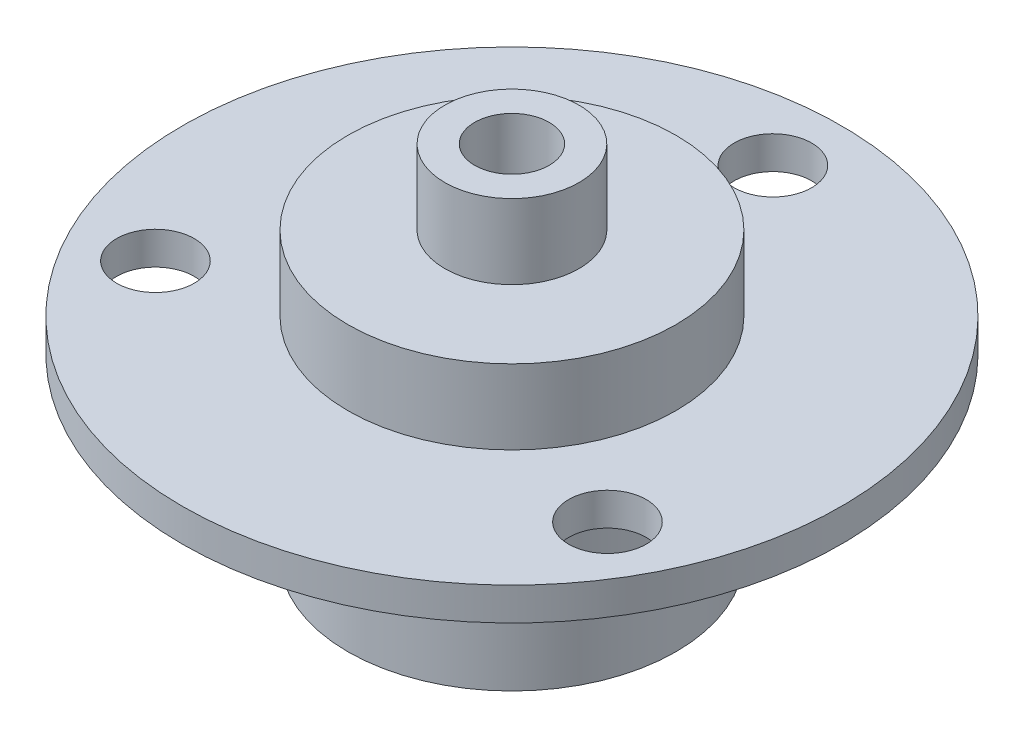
ISO-10303-21;
HEADER;
FILE_DESCRIPTION(('STEP AP214'),'2;1');
FILE_NAME('part.step','',(''),(''),'','','');
FILE_SCHEMA(('AUTOMOTIVE_DESIGN { 1 0 10303 214 1 1 1 1 }'));
ENDSEC;
DATA;
#1=APPLICATION_CONTEXT('core data for automotive mechanical design processes');
#2=APPLICATION_PROTOCOL_DEFINITION('international standard','automotive_design',2000,#1);
#3=PRODUCT_CONTEXT('',#1,'mechanical');
#4=PRODUCT('Part','Part','',(#3));
#5=PRODUCT_RELATED_PRODUCT_CATEGORY('part','',(#4));
#6=PRODUCT_DEFINITION_FORMATION('','',#4);
#7=PRODUCT_DEFINITION_CONTEXT('part definition',#1,'design');
#8=PRODUCT_DEFINITION('design','',#6,#7);
#9=PRODUCT_DEFINITION_SHAPE('','',#8);
#10=(LENGTH_UNIT() NAMED_UNIT(*) SI_UNIT(.MILLI.,.METRE.));
#11=(NAMED_UNIT(*) PLANE_ANGLE_UNIT() SI_UNIT($,.RADIAN.));
#12=(NAMED_UNIT(*) SI_UNIT($,.STERADIAN.) SOLID_ANGLE_UNIT());
#13=UNCERTAINTY_MEASURE_WITH_UNIT(LENGTH_MEASURE(1.E-05),#10,'distance_accuracy_value','');
#14=(GEOMETRIC_REPRESENTATION_CONTEXT(3) GLOBAL_UNCERTAINTY_ASSIGNED_CONTEXT((#13)) GLOBAL_UNIT_ASSIGNED_CONTEXT((#10,
#11,#12)) REPRESENTATION_CONTEXT('',''));
#15=CARTESIAN_POINT('',(0.,0.,0.));
#16=DIRECTION('',(0.,0.,1.));
#17=DIRECTION('',(1.,0.,0.));
#18=AXIS2_PLACEMENT_3D('',#15,#16,#17);
#19=CARTESIAN_POINT('',(0.,2.2,0.));
#20=DIRECTION('',(0.,-1.,0.));
#21=DIRECTION('',(0.,0.,-1.));
#22=AXIS2_PLACEMENT_3D('',#19,#20,#21);
#23=CYLINDRICAL_SURFACE('',#22,22.1);
#24=CARTESIAN_POINT('',(0.,2.2,0.));
#25=DIRECTION('',(0.,1.,0.));
#26=DIRECTION('',(0.,0.,1.));
#27=AXIS2_PLACEMENT_3D('',#24,#25,#26);
#28=CIRCLE('',#27,22.1);
#29=CARTESIAN_POINT('',(0.,2.2,22.1));
#30=VERTEX_POINT('',#29);
#31=EDGE_CURVE('E47',#30,#30,#28,.T.);
#32=ORIENTED_EDGE('',*,*,#31,.F.);
#33=EDGE_LOOP('',(#32));
#34=FACE_BOUND('',#33,.T.);
#35=CARTESIAN_POINT('',(0.,0.,0.));
#36=DIRECTION('',(0.,1.,0.));
#37=DIRECTION('',(0.,0.,1.));
#38=AXIS2_PLACEMENT_3D('',#35,#36,#37);
#39=CIRCLE('',#38,22.1);
#40=CARTESIAN_POINT('',(0.,0.,22.1));
#41=VERTEX_POINT('',#40);
#42=EDGE_CURVE('E79',#41,#41,#39,.T.);
#43=ORIENTED_EDGE('',*,*,#42,.T.);
#44=EDGE_LOOP('',(#43));
#45=FACE_BOUND('',#44,.T.);
#46=ADVANCED_FACE('F35',(#34,#45),#23,.T.);
#47=CARTESIAN_POINT('',(0.,2.2,0.));
#48=DIRECTION('',(0.,1.,0.));
#49=DIRECTION('',(0.,0.,1.));
#50=AXIS2_PLACEMENT_3D('',#47,#48,#49);
#51=PLANE('',#50);
#52=CARTESIAN_POINT('',(0.,2.2,0.));
#53=DIRECTION('',(0.,1.,0.));
#54=DIRECTION('',(0.,0.,1.));
#55=AXIS2_PLACEMENT_3D('',#52,#53,#54);
#56=CIRCLE('',#55,11.);
#57=CARTESIAN_POINT('',(0.,2.2,11.));
#58=VERTEX_POINT('',#57);
#59=EDGE_CURVE('E55',#58,#58,#56,.T.);
#60=ORIENTED_EDGE('',*,*,#59,.F.);
#61=EDGE_LOOP('',(#60));
#62=FACE_BOUND('',#61,.T.);
#63=CARTESIAN_POINT('',(0.,2.2,-17.5));
#64=DIRECTION('',(0.,1.,0.));
#65=DIRECTION('',(0.,0.,1.));
#66=AXIS2_PLACEMENT_3D('',#63,#64,#65);
#67=CIRCLE('',#66,2.6);
#68=CARTESIAN_POINT('',(0.,2.2,-14.9));
#69=VERTEX_POINT('',#68);
#70=EDGE_CURVE('E76',#69,#69,#67,.T.);
#71=ORIENTED_EDGE('',*,*,#70,.F.);
#72=EDGE_LOOP('',(#71));
#73=FACE_BOUND('',#72,.T.);
#74=CARTESIAN_POINT('',(15.1554445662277,2.2,8.75));
#75=DIRECTION('',(0.,1.,0.));
#76=DIRECTION('',(0.,0.,1.));
#77=AXIS2_PLACEMENT_3D('',#74,#75,#76);
#78=CIRCLE('',#77,2.60000000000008);
#79=CARTESIAN_POINT('',(15.1554445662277,2.2,11.3500000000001));
#80=VERTEX_POINT('',#79);
#81=EDGE_CURVE('E73',#80,#80,#78,.T.);
#82=ORIENTED_EDGE('',*,*,#81,.F.);
#83=EDGE_LOOP('',(#82));
#84=FACE_BOUND('',#83,.T.);
#85=CARTESIAN_POINT('',(-15.1554445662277,2.2,8.75000000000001));
#86=DIRECTION('',(0.,1.,0.));
#87=DIRECTION('',(0.,0.,1.));
#88=AXIS2_PLACEMENT_3D('',#85,#86,#87);
#89=CIRCLE('',#88,2.60000000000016);
#90=CARTESIAN_POINT('',(-15.1554445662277,2.2,11.3500000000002));
#91=VERTEX_POINT('',#90);
#92=EDGE_CURVE('E65',#91,#91,#89,.T.);
#93=ORIENTED_EDGE('',*,*,#92,.F.);
#94=EDGE_LOOP('',(#93));
#95=FACE_BOUND('',#94,.T.);
#96=ORIENTED_EDGE('',*,*,#31,.T.);
#97=EDGE_LOOP('',(#96));
#98=FACE_BOUND('',#97,.T.);
#99=ADVANCED_FACE('F89',(#62,#73,#84,#95,#98),#51,.T.);
#100=CARTESIAN_POINT('',(0.,0.,0.));
#101=DIRECTION('',(0.,1.,0.));
#102=DIRECTION('',(0.,0.,1.));
#103=AXIS2_PLACEMENT_3D('',#100,#101,#102);
#104=PLANE('',#103);
#105=CARTESIAN_POINT('',(0.,0.,0.));
#106=DIRECTION('',(0.,1.,0.));
#107=DIRECTION('',(0.,0.,1.));
#108=AXIS2_PLACEMENT_3D('',#105,#106,#107);
#109=CIRCLE('',#108,11.);
#110=CARTESIAN_POINT('',(0.,0.,11.));
#111=VERTEX_POINT('',#110);
#112=EDGE_CURVE('E42',#111,#111,#109,.F.);
#113=ORIENTED_EDGE('',*,*,#112,.F.);
#114=EDGE_LOOP('',(#113));
#115=FACE_BOUND('',#114,.T.);
#116=CARTESIAN_POINT('',(0.,0.,-17.5));
#117=DIRECTION('',(0.,1.,0.));
#118=DIRECTION('',(0.,0.,1.));
#119=AXIS2_PLACEMENT_3D('',#116,#117,#118);
#120=CIRCLE('',#119,2.6);
#121=CARTESIAN_POINT('',(0.,0.,-14.9));
#122=VERTEX_POINT('',#121);
#123=EDGE_CURVE('E62',#122,#122,#120,.T.);
#124=ORIENTED_EDGE('',*,*,#123,.T.);
#125=EDGE_LOOP('',(#124));
#126=FACE_BOUND('',#125,.T.);
#127=CARTESIAN_POINT('',(15.1554445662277,0.,8.75));
#128=DIRECTION('',(0.,1.,0.));
#129=DIRECTION('',(0.,0.,1.));
#130=AXIS2_PLACEMENT_3D('',#127,#128,#129);
#131=CIRCLE('',#130,2.60000000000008);
#132=CARTESIAN_POINT('',(15.1554445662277,0.,11.3500000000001));
#133=VERTEX_POINT('',#132);
#134=EDGE_CURVE('E66',#133,#133,#131,.T.);
#135=ORIENTED_EDGE('',*,*,#134,.T.);
#136=EDGE_LOOP('',(#135));
#137=FACE_BOUND('',#136,.T.);
#138=CARTESIAN_POINT('',(-15.1554445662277,0.,8.75000000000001));
#139=DIRECTION('',(0.,1.,0.));
#140=DIRECTION('',(0.,0.,1.));
#141=AXIS2_PLACEMENT_3D('',#138,#139,#140);
#142=CIRCLE('',#141,2.60000000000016);
#143=CARTESIAN_POINT('',(-15.1554445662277,0.,11.3500000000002));
#144=VERTEX_POINT('',#143);
#145=EDGE_CURVE('E59',#144,#144,#142,.T.);
#146=ORIENTED_EDGE('',*,*,#145,.T.);
#147=EDGE_LOOP('',(#146));
#148=FACE_BOUND('',#147,.T.);
#149=ORIENTED_EDGE('',*,*,#42,.F.);
#150=EDGE_LOOP('',(#149));
#151=FACE_BOUND('',#150,.T.);
#152=ADVANCED_FACE('F86',(#115,#126,#137,#148,#151),#104,.F.);
#153=CARTESIAN_POINT('',(-15.1554445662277,0.,8.75000000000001));
#154=DIRECTION('',(0.,1.,0.));
#155=DIRECTION('',(0.,0.,1.));
#156=AXIS2_PLACEMENT_3D('',#153,#154,#155);
#157=CYLINDRICAL_SURFACE('',#156,2.60000000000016);
#158=ORIENTED_EDGE('',*,*,#92,.T.);
#159=EDGE_LOOP('',(#158));
#160=FACE_BOUND('',#159,.T.);
#161=ORIENTED_EDGE('',*,*,#145,.F.);
#162=EDGE_LOOP('',(#161));
#163=FACE_BOUND('',#162,.T.);
#164=ADVANCED_FACE('F88',(#160,#163),#157,.F.);
#165=CARTESIAN_POINT('',(15.1554445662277,0.,8.75));
#166=DIRECTION('',(0.,1.,0.));
#167=DIRECTION('',(0.,0.,1.));
#168=AXIS2_PLACEMENT_3D('',#165,#166,#167);
#169=CYLINDRICAL_SURFACE('',#168,2.60000000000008);
#170=ORIENTED_EDGE('',*,*,#81,.T.);
#171=EDGE_LOOP('',(#170));
#172=FACE_BOUND('',#171,.T.);
#173=ORIENTED_EDGE('',*,*,#134,.F.);
#174=EDGE_LOOP('',(#173));
#175=FACE_BOUND('',#174,.T.);
#176=ADVANCED_FACE('F95',(#172,#175),#169,.F.);
#177=CARTESIAN_POINT('',(0.,0.,-17.5));
#178=DIRECTION('',(0.,1.,0.));
#179=DIRECTION('',(0.,0.,1.));
#180=AXIS2_PLACEMENT_3D('',#177,#178,#179);
#181=CYLINDRICAL_SURFACE('',#180,2.6);
#182=ORIENTED_EDGE('',*,*,#70,.T.);
#183=EDGE_LOOP('',(#182));
#184=FACE_BOUND('',#183,.T.);
#185=ORIENTED_EDGE('',*,*,#123,.F.);
#186=EDGE_LOOP('',(#185));
#187=FACE_BOUND('',#186,.T.);
#188=ADVANCED_FACE('F121',(#184,#187),#181,.F.);
#189=CARTESIAN_POINT('',(0.,7.2,0.));
#190=DIRECTION('',(0.,-1.,0.));
#191=DIRECTION('',(0.,0.,-1.));
#192=AXIS2_PLACEMENT_3D('',#189,#190,#191);
#193=CYLINDRICAL_SURFACE('',#192,11.);
#194=CARTESIAN_POINT('',(0.,7.2,0.));
#195=DIRECTION('',(0.,1.,0.));
#196=DIRECTION('',(0.,0.,1.));
#197=AXIS2_PLACEMENT_3D('',#194,#195,#196);
#198=CIRCLE('',#197,11.);
#199=CARTESIAN_POINT('',(0.,7.2,11.));
#200=VERTEX_POINT('',#199);
#201=EDGE_CURVE('E56',#200,#200,#198,.T.);
#202=ORIENTED_EDGE('',*,*,#201,.F.);
#203=EDGE_LOOP('',(#202));
#204=FACE_BOUND('',#203,.T.);
#205=ORIENTED_EDGE('',*,*,#59,.T.);
#206=EDGE_LOOP('',(#205));
#207=FACE_BOUND('',#206,.T.);
#208=ADVANCED_FACE('F126',(#204,#207),#193,.T.);
#209=CARTESIAN_POINT('',(0.,7.2,0.));
#210=DIRECTION('',(0.,1.,0.));
#211=DIRECTION('',(0.,0.,1.));
#212=AXIS2_PLACEMENT_3D('',#209,#210,#211);
#213=PLANE('',#212);
#214=CARTESIAN_POINT('',(0.,7.2,0.));
#215=DIRECTION('',(0.,1.,0.));
#216=DIRECTION('',(0.,0.,1.));
#217=AXIS2_PLACEMENT_3D('',#214,#215,#216);
#218=CIRCLE('',#217,4.5);
#219=CARTESIAN_POINT('',(0.,7.2,4.5));
#220=VERTEX_POINT('',#219);
#221=EDGE_CURVE('E10',#220,#220,#218,.T.);
#222=ORIENTED_EDGE('',*,*,#221,.F.);
#223=EDGE_LOOP('',(#222));
#224=FACE_BOUND('',#223,.T.);
#225=ORIENTED_EDGE('',*,*,#201,.T.);
#226=EDGE_LOOP('',(#225));
#227=FACE_BOUND('',#226,.T.);
#228=ADVANCED_FACE('F130',(#224,#227),#213,.T.);
#229=CARTESIAN_POINT('',(0.,-11.8,0.));
#230=DIRECTION('',(0.,1.,0.));
#231=DIRECTION('',(0.,0.,1.));
#232=AXIS2_PLACEMENT_3D('',#229,#230,#231);
#233=CYLINDRICAL_SURFACE('',#232,11.);
#234=CARTESIAN_POINT('',(0.,-11.8,0.));
#235=DIRECTION('',(0.,-1.,0.));
#236=DIRECTION('',(0.,0.,-1.));
#237=AXIS2_PLACEMENT_3D('',#234,#235,#236);
#238=CIRCLE('',#237,11.);
#239=CARTESIAN_POINT('',(0.,-11.8,-11.));
#240=VERTEX_POINT('',#239);
#241=EDGE_CURVE('E52',#240,#240,#238,.T.);
#242=ORIENTED_EDGE('',*,*,#241,.F.);
#243=EDGE_LOOP('',(#242));
#244=FACE_BOUND('',#243,.T.);
#245=ORIENTED_EDGE('',*,*,#112,.T.);
#246=EDGE_LOOP('',(#245));
#247=FACE_BOUND('',#246,.T.);
#248=ADVANCED_FACE('F145',(#244,#247),#233,.T.);
#249=CARTESIAN_POINT('',(0.,-11.8,0.));
#250=DIRECTION('',(0.,-1.,0.));
#251=DIRECTION('',(0.,0.,-1.));
#252=AXIS2_PLACEMENT_3D('',#249,#250,#251);
#253=PLANE('',#252);
#254=CARTESIAN_POINT('',(0.,-11.8,0.));
#255=DIRECTION('',(0.,1.,0.));
#256=DIRECTION('',(0.,0.,1.));
#257=AXIS2_PLACEMENT_3D('',#254,#255,#256);
#258=CIRCLE('',#257,2.5);
#259=CARTESIAN_POINT('',(0.,-11.8,2.5));
#260=VERTEX_POINT('',#259);
#261=EDGE_CURVE('E262',#260,#260,#258,.T.);
#262=ORIENTED_EDGE('',*,*,#261,.T.);
#263=EDGE_LOOP('',(#262));
#264=FACE_BOUND('',#263,.T.);
#265=ORIENTED_EDGE('',*,*,#241,.T.);
#266=EDGE_LOOP('',(#265));
#267=FACE_BOUND('',#266,.T.);
#268=ADVANCED_FACE('F150',(#264,#267),#253,.T.);
#269=CARTESIAN_POINT('',(0.,12.2,0.));
#270=DIRECTION('',(0.,-1.,0.));
#271=DIRECTION('',(0.,0.,-1.));
#272=AXIS2_PLACEMENT_3D('',#269,#270,#271);
#273=CYLINDRICAL_SURFACE('',#272,4.5);
#274=CARTESIAN_POINT('',(0.,12.2,0.));
#275=DIRECTION('',(0.,1.,0.));
#276=DIRECTION('',(0.,0.,1.));
#277=AXIS2_PLACEMENT_3D('',#274,#275,#276);
#278=CIRCLE('',#277,4.5);
#279=CARTESIAN_POINT('',(0.,12.2,4.5));
#280=VERTEX_POINT('',#279);
#281=EDGE_CURVE('E50',#280,#280,#278,.T.);
#282=ORIENTED_EDGE('',*,*,#281,.F.);
#283=EDGE_LOOP('',(#282));
#284=FACE_BOUND('',#283,.T.);
#285=ORIENTED_EDGE('',*,*,#221,.T.);
#286=EDGE_LOOP('',(#285));
#287=FACE_BOUND('',#286,.T.);
#288=ADVANCED_FACE('F167',(#284,#287),#273,.T.);
#289=CARTESIAN_POINT('',(0.,12.2,0.));
#290=DIRECTION('',(0.,1.,0.));
#291=DIRECTION('',(0.,0.,1.));
#292=AXIS2_PLACEMENT_3D('',#289,#290,#291);
#293=PLANE('',#292);
#294=CARTESIAN_POINT('',(0.,12.2,0.));
#295=DIRECTION('',(0.,1.,0.));
#296=DIRECTION('',(0.,0.,1.));
#297=AXIS2_PLACEMENT_3D('',#294,#295,#296);
#298=CIRCLE('',#297,2.5);
#299=CARTESIAN_POINT('',(0.,12.2,2.5));
#300=VERTEX_POINT('',#299);
#301=EDGE_CURVE('E38',#300,#300,#298,.T.);
#302=ORIENTED_EDGE('',*,*,#301,.F.);
#303=EDGE_LOOP('',(#302));
#304=FACE_BOUND('',#303,.T.);
#305=ORIENTED_EDGE('',*,*,#281,.T.);
#306=EDGE_LOOP('',(#305));
#307=FACE_BOUND('',#306,.T.);
#308=ADVANCED_FACE('F172',(#304,#307),#293,.T.);
#309=CARTESIAN_POINT('',(0.,-11.8,0.));
#310=DIRECTION('',(0.,1.,0.));
#311=DIRECTION('',(0.,0.,1.));
#312=AXIS2_PLACEMENT_3D('',#309,#310,#311);
#313=CYLINDRICAL_SURFACE('',#312,2.5);
#314=ORIENTED_EDGE('',*,*,#301,.T.);
#315=EDGE_LOOP('',(#314));
#316=FACE_BOUND('',#315,.T.);
#317=ORIENTED_EDGE('',*,*,#261,.F.);
#318=EDGE_LOOP('',(#317));
#319=FACE_BOUND('',#318,.T.);
#320=ADVANCED_FACE('F191',(#316,#319),#313,.F.);
#321=CLOSED_SHELL('',(#46,#99,#152,#164,#176,#188,#208,#228,#248,#268,#288,#308,#320));
#322=MANIFOLD_SOLID_BREP('B2',#321);
#323=ADVANCED_BREP_SHAPE_REPRESENTATION('',(#18,#322),#14);
#324=SHAPE_DEFINITION_REPRESENTATION(#9,#323);
ENDSEC;
END-ISO-10303-21;
